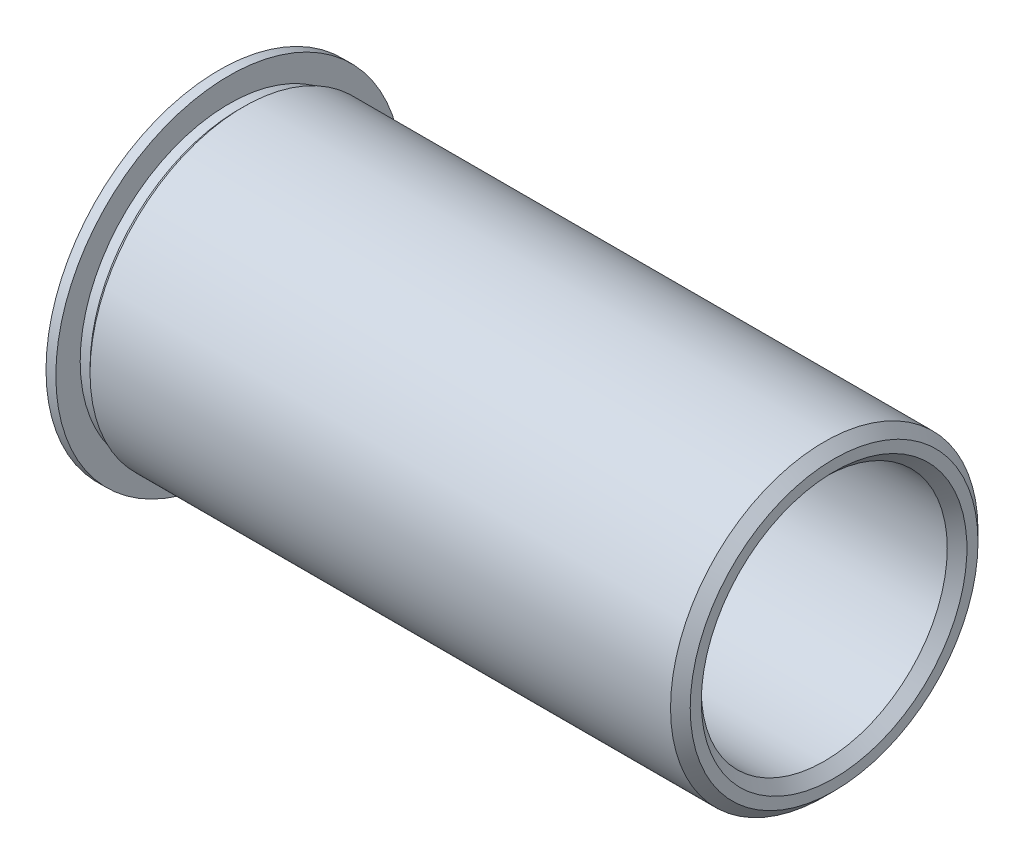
from build123d import *

# Parameters (mm, degrees)
SKETCH3_R          = 3.175
CUT_EXTRUDE1_DEPTH = 101.485752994
CHAMFER2_SIZE      = 0.254
CHAMFER3_SIZE      = 0.254


with BuildPart() as part:
    # Sketch2 → Revolve3 (revolve)
    with BuildSketch(Plane.XY, mode=Mode.PRIVATE) as revolve3_sk:
        Polygon((-60.966082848, 94.652687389), (-60.966082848, 99.123087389), (-60.712082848, 99.123087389), (-60.712082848, 98.494437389), (-60.458082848, 98.494437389), (-60.331082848, 98.621437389), (-45.345082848, 98.621437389), (-45.091082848, 98.367437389), (-45.091082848, 94.652687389), align=None)
    revolve(revolve3_sk.sketch.rotate(Axis((-60.966082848, 94.652687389, 0), (1, 0, 0)), 90), axis=Axis((-60.966082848, 94.652687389, 0), (1, 0, 0)))

    # Sketch3 → Cut-Extrude1 (cut, through all)
    with BuildSketch(Plane(origin=(-45.091082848, 0, 0), x_dir=(0, 0, -1), z_dir=(1, 0, 0))):
        with Locations((0, 94.652687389)):
            Circle(SKETCH3_R)
    extrude(amount=-CUT_EXTRUDE1_DEPTH, mode=Mode.SUBTRACT)

    # Chamfer2
    chamfer2_edges = [part.edges().sort_by_distance(p)[0] for p in [
        (-60.966082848, 94.652687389, 3.175),
    ]]
    chamfer(chamfer2_edges, length=CHAMFER2_SIZE)

    # Chamfer3
    chamfer3_edges = [part.edges().sort_by_distance(p)[0] for p in [
        (-45.091082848, 94.652687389, 3.175),
    ]]
    chamfer(chamfer3_edges, length=CHAMFER3_SIZE)


solid = part.part
